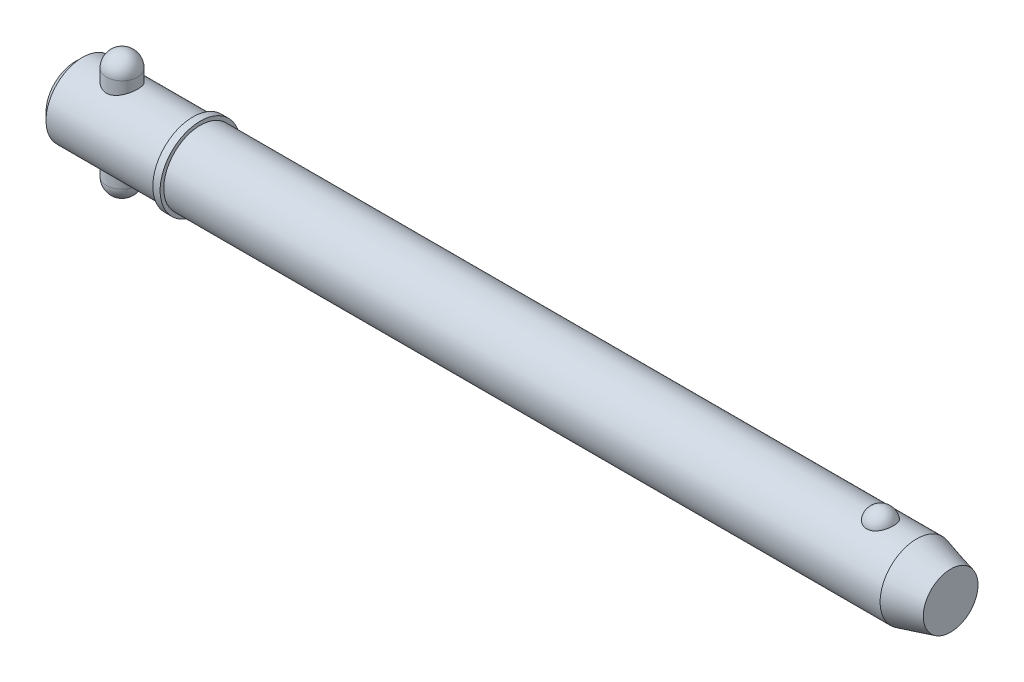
ISO-10303-21;
HEADER;
FILE_DESCRIPTION(('STEP AP214'),'2;1');
FILE_NAME('part.step','',(''),(''),'','','');
FILE_SCHEMA(('AUTOMOTIVE_DESIGN { 1 0 10303 214 1 1 1 1 }'));
ENDSEC;
DATA;
#1=APPLICATION_CONTEXT('core data for automotive mechanical design processes');
#2=APPLICATION_PROTOCOL_DEFINITION('international standard','automotive_design',2000,#1);
#3=PRODUCT_CONTEXT('',#1,'mechanical');
#4=PRODUCT('Part','Part','',(#3));
#5=PRODUCT_RELATED_PRODUCT_CATEGORY('part','',(#4));
#6=PRODUCT_DEFINITION_FORMATION('','',#4);
#7=PRODUCT_DEFINITION_CONTEXT('part definition',#1,'design');
#8=PRODUCT_DEFINITION('design','',#6,#7);
#9=PRODUCT_DEFINITION_SHAPE('','',#8);
#10=(LENGTH_UNIT() NAMED_UNIT(*) SI_UNIT(.MILLI.,.METRE.));
#11=(NAMED_UNIT(*) PLANE_ANGLE_UNIT() SI_UNIT($,.RADIAN.));
#12=(NAMED_UNIT(*) SI_UNIT($,.STERADIAN.) SOLID_ANGLE_UNIT());
#13=UNCERTAINTY_MEASURE_WITH_UNIT(LENGTH_MEASURE(1.E-05),#10,'distance_accuracy_value','');
#14=(GEOMETRIC_REPRESENTATION_CONTEXT(3) GLOBAL_UNCERTAINTY_ASSIGNED_CONTEXT((#13)) GLOBAL_UNIT_ASSIGNED_CONTEXT((#10,
#11,#12)) REPRESENTATION_CONTEXT('',''));
#15=CARTESIAN_POINT('',(0.,0.,0.));
#16=DIRECTION('',(0.,0.,1.));
#17=DIRECTION('',(1.,0.,0.));
#18=AXIS2_PLACEMENT_3D('',#15,#16,#17);
#19=CARTESIAN_POINT('',(14.28,19.05,0.));
#20=DIRECTION('',(0.,-1.,0.));
#21=DIRECTION('',(0.,0.,-1.));
#22=AXIS2_PLACEMENT_3D('',#19,#20,#21);
#23=CYLINDRICAL_SURFACE('',#22,4.76);
#24=CARTESIAN_POINT('',(14.28,-14.29,0.));
#25=DIRECTION('',(0.,-1.,0.));
#26=DIRECTION('',(0.,0.,-1.));
#27=AXIS2_PLACEMENT_3D('',#24,#25,#26);
#28=CIRCLE('',#27,4.76);
#29=CARTESIAN_POINT('',(14.28,-14.29,-4.76));
#30=VERTEX_POINT('',#29);
#31=EDGE_CURVE('P0_E10',#30,#30,#28,.F.);
#32=CARTESIAN_POINT('',(14.28,14.29,0.));
#33=DIRECTION('',(0.,-1.,0.));
#34=DIRECTION('',(0.,0.,-1.));
#35=AXIS2_PLACEMENT_3D('',#32,#33,#34);
#36=CIRCLE('',#35,4.76);
#37=CARTESIAN_POINT('',(14.28,14.29,-4.76));
#38=VERTEX_POINT('',#37);
#39=EDGE_CURVE('P0_E21',#38,#38,#36,.T.);
#40=CARTESIAN_POINT('',(14.28,-14.29,-4.76));
#41=CARTESIAN_POINT('',(14.28,-13.9922916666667,-4.76));
#42=CARTESIAN_POINT('',(14.28,-13.6945833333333,-4.76));
#43=CARTESIAN_POINT('',(14.28,-13.0991666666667,-4.76));
#44=CARTESIAN_POINT('',(14.28,-12.8014583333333,-4.76));
#45=CARTESIAN_POINT('',(14.28,-12.2060416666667,-4.76));
#46=CARTESIAN_POINT('',(14.28,-11.9083333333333,-4.76));
#47=CARTESIAN_POINT('',(14.28,-11.3129166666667,-4.76));
#48=CARTESIAN_POINT('',(14.28,-11.0152083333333,-4.76));
#49=CARTESIAN_POINT('',(14.28,-10.4197916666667,-4.76));
#50=CARTESIAN_POINT('',(14.28,-10.1220833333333,-4.76));
#51=CARTESIAN_POINT('',(14.28,-9.52666666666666,-4.76));
#52=CARTESIAN_POINT('',(14.28,-9.22895833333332,-4.76));
#53=CARTESIAN_POINT('',(14.28,-8.63354166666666,-4.76));
#54=CARTESIAN_POINT('',(14.28,-8.33583333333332,-4.76));
#55=CARTESIAN_POINT('',(14.28,-7.74041666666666,-4.76));
#56=CARTESIAN_POINT('',(14.28,-7.44270833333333,-4.76));
#57=CARTESIAN_POINT('',(14.28,-6.84729166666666,-4.76));
#58=CARTESIAN_POINT('',(14.28,-6.54958333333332,-4.76));
#59=CARTESIAN_POINT('',(14.28,-5.95416666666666,-4.76));
#60=CARTESIAN_POINT('',(14.28,-5.65645833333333,-4.76));
#61=CARTESIAN_POINT('',(14.28,-5.06104166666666,-4.76));
#62=CARTESIAN_POINT('',(14.28,-4.76333333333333,-4.76));
#63=CARTESIAN_POINT('',(14.28,-4.16791666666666,-4.76));
#64=CARTESIAN_POINT('',(14.28,-3.87020833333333,-4.76));
#65=CARTESIAN_POINT('',(14.28,-3.27479166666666,-4.76));
#66=CARTESIAN_POINT('',(14.28,-2.97708333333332,-4.76));
#67=CARTESIAN_POINT('',(14.28,-2.38166666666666,-4.76));
#68=CARTESIAN_POINT('',(14.28,-2.08395833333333,-4.76));
#69=CARTESIAN_POINT('',(14.28,-1.48854166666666,-4.76));
#70=CARTESIAN_POINT('',(14.28,-1.19083333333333,-4.76));
#71=CARTESIAN_POINT('',(14.28,-0.595416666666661,-4.76));
#72=CARTESIAN_POINT('',(14.28,-0.297708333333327,-4.76));
#73=CARTESIAN_POINT('',(14.28,0.297708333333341,-4.76));
#74=CARTESIAN_POINT('',(14.28,0.595416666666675,-4.76));
#75=CARTESIAN_POINT('',(14.28,1.19083333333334,-4.76));
#76=CARTESIAN_POINT('',(14.28,1.48854166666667,-4.76));
#77=CARTESIAN_POINT('',(14.28,2.08395833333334,-4.76));
#78=CARTESIAN_POINT('',(14.28,2.38166666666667,-4.76));
#79=CARTESIAN_POINT('',(14.28,2.97708333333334,-4.76));
#80=CARTESIAN_POINT('',(14.28,3.27479166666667,-4.76));
#81=CARTESIAN_POINT('',(14.28,3.87020833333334,-4.76));
#82=CARTESIAN_POINT('',(14.28,4.16791666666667,-4.76));
#83=CARTESIAN_POINT('',(14.28,4.76333333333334,-4.76));
#84=CARTESIAN_POINT('',(14.28,5.06104166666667,-4.76));
#85=CARTESIAN_POINT('',(14.28,5.65645833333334,-4.76));
#86=CARTESIAN_POINT('',(14.28,5.95416666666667,-4.76));
#87=CARTESIAN_POINT('',(14.28,6.54958333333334,-4.76));
#88=CARTESIAN_POINT('',(14.28,6.84729166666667,-4.76));
#89=CARTESIAN_POINT('',(14.28,7.44270833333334,-4.76));
#90=CARTESIAN_POINT('',(14.28,7.74041666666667,-4.76));
#91=CARTESIAN_POINT('',(14.28,8.33583333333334,-4.76));
#92=CARTESIAN_POINT('',(14.28,8.63354166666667,-4.76));
#93=CARTESIAN_POINT('',(14.28,9.22895833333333,-4.76));
#94=CARTESIAN_POINT('',(14.28,9.52666666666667,-4.76));
#95=CARTESIAN_POINT('',(14.28,10.1220833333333,-4.76));
#96=CARTESIAN_POINT('',(14.28,10.4197916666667,-4.76));
#97=CARTESIAN_POINT('',(14.28,11.0152083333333,-4.76));
#98=CARTESIAN_POINT('',(14.28,11.3129166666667,-4.76));
#99=CARTESIAN_POINT('',(14.28,11.9083333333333,-4.76));
#100=CARTESIAN_POINT('',(14.28,12.2060416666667,-4.76));
#101=CARTESIAN_POINT('',(14.28,12.8014583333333,-4.76));
#102=CARTESIAN_POINT('',(14.28,13.0991666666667,-4.76));
#103=CARTESIAN_POINT('',(14.28,13.6945833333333,-4.76));
#104=CARTESIAN_POINT('',(14.28,13.9922916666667,-4.76));
#105=CARTESIAN_POINT('',(14.28,14.29,-4.76));
#106=B_SPLINE_CURVE_WITH_KNOTS('',3,(#40,#41,#42,#43,#44,#45,#46,#47,#48,#49,#50,#51,#52,#53,
#54,#55,#56,#57,#58,#59,#60,#61,#62,#63,#64,#65,#66,#67,#68,#69,#70,#71,#72,#73,#74,#75,#76,#77,
#78,#79,#80,#81,#82,#83,#84,#85,#86,#87,#88,#89,#90,#91,#92,#93,#94,#95,#96,#97,#98,#99,#100,
#101,#102,#103,#104,#105),.UNSPECIFIED.,.F.,.F.,(4,2,2,2,2,2,2,2,2,2,2,2,2,2,2,2,2,2,2,2,2,2,2,
2,2,2,2,2,2,2,2,2,4),(0.,0.893125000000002,1.78625,2.67937499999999,3.5725,4.465625,5.35875,
6.25187499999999,7.145,8.038125,8.93125,9.82437499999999,10.7175,11.610625,12.50375,13.396875,
14.29,15.183125,16.07625,16.969375,17.8625,18.755625,19.64875,20.541875,21.435,22.328125,
23.22125,24.114375,25.0075,25.900625,26.79375,27.686875,28.58),.UNSPECIFIED.);
#107=EDGE_CURVE('P0_BSEAM14',#30,#38,#106,.T.);
#108=ORIENTED_EDGE('',*,*,#31,.T.);
#109=ORIENTED_EDGE('',*,*,#39,.T.);
#110=ORIENTED_EDGE('',*,*,#107,.T.);
#111=ORIENTED_EDGE('',*,*,#107,.F.);
#112=EDGE_LOOP('',(#108,#110,#109,#111));
#113=FACE_BOUND('',#112,.T.);
#114=ADVANCED_FACE('P0_F14',(#113),#23,.T.);
#115=CARTESIAN_POINT('',(14.28,-14.29,0.));
#116=DIRECTION('',(0.,0.,1.));
#117=DIRECTION('',(1.,0.,0.));
#118=AXIS2_PLACEMENT_3D('',#115,#116,#117);
#119=SPHERICAL_SURFACE('',#118,4.76);
#120=CARTESIAN_POINT('',(14.28,-14.29,0.));
#121=DIRECTION('',(0.,-1.,0.));
#122=DIRECTION('',(0.,0.,-1.));
#123=AXIS2_PLACEMENT_3D('',#120,#121,#122);
#124=SPHERICAL_SURFACE('',#123,4.76);
#125=ORIENTED_EDGE('',*,*,#31,.F.);
#126=EDGE_LOOP('',(#125));
#127=FACE_BOUND('',#126,.T.);
#128=ADVANCED_FACE('P0_F29',(#127),#124,.T.);
#129=CARTESIAN_POINT('',(14.28,14.29,0.));
#130=DIRECTION('',(0.,0.,1.));
#131=DIRECTION('',(1.,0.,0.));
#132=AXIS2_PLACEMENT_3D('',#129,#130,#131);
#133=SPHERICAL_SURFACE('',#132,4.76);
#134=CARTESIAN_POINT('',(14.28,14.29,0.));
#135=DIRECTION('',(0.,-1.,0.));
#136=DIRECTION('',(0.,0.,-1.));
#137=AXIS2_PLACEMENT_3D('',#134,#135,#136);
#138=SPHERICAL_SURFACE('',#137,4.76);
#139=ORIENTED_EDGE('',*,*,#39,.F.);
#140=EDGE_LOOP('',(#139));
#141=FACE_BOUND('',#140,.T.);
#142=ADVANCED_FACE('P0_F16',(#141),#138,.T.);
#143=CLOSED_SHELL('',(#114,#128,#142));
#144=MANIFOLD_SOLID_BREP('P0_B1',#143);
#145=CARTESIAN_POINT('',(0.,0.,0.));
#146=DIRECTION('',(1.,0.,0.));
#147=DIRECTION('',(0.,0.,-1.));
#148=AXIS2_PLACEMENT_3D('',#145,#146,#147);
#149=CYLINDRICAL_SURFACE('',#148,11.115);
#150=CARTESIAN_POINT('',(256.329563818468,0.,0.));
#151=DIRECTION('',(1.,0.,0.));
#152=DIRECTION('',(0.,0.,-1.));
#153=AXIS2_PLACEMENT_3D('',#150,#151,#152);
#154=CIRCLE('',#153,11.115);
#155=CARTESIAN_POINT('',(256.329563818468,0.,-11.115));
#156=VERTEX_POINT('',#155);
#157=EDGE_CURVE('P1_E81',#156,#156,#154,.T.);
#158=ORIENTED_EDGE('',*,*,#157,.F.);
#159=EDGE_LOOP('',(#158));
#160=FACE_BOUND('',#159,.T.);
#161=CARTESIAN_POINT('',(38.1,0.,0.));
#162=DIRECTION('',(1.,0.,0.));
#163=DIRECTION('',(0.,0.,-1.));
#164=AXIS2_PLACEMENT_3D('',#161,#162,#163);
#165=CIRCLE('',#164,11.115);
#166=CARTESIAN_POINT('',(38.1,0.,-11.115));
#167=VERTEX_POINT('',#166);
#168=EDGE_CURVE('P1_E85',#167,#167,#165,.T.);
#169=ORIENTED_EDGE('',*,*,#168,.T.);
#170=EDGE_LOOP('',(#169));
#171=FACE_BOUND('',#170,.T.);
#172=CARTESIAN_POINT('',(245.331068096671,10.3028087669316,4.17077409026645));
#173=CARTESIAN_POINT('',(245.114775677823,10.3028003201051,4.17078240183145));
#174=CARTESIAN_POINT('',(244.898548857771,10.3098895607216,4.15340593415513));
#175=CARTESIAN_POINT('',(244.472540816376,10.3373834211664,4.08449540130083));
#176=CARTESIAN_POINT('',(244.262757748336,10.3577841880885,4.0329712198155));
#177=CARTESIAN_POINT('',(243.855782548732,10.4095237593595,3.89746513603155));
#178=CARTESIAN_POINT('',(243.658572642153,10.4408466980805,3.81353029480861));
#179=CARTESIAN_POINT('',(243.281338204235,10.5110236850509,3.61560339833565));
#180=CARTESIAN_POINT('',(243.101317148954,10.5498792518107,3.50160528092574));
#181=CARTESIAN_POINT('',(242.757684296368,10.6322884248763,3.24292464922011));
#182=CARTESIAN_POINT('',(242.594686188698,10.6759443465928,3.09746040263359));
#183=CARTESIAN_POINT('',(242.294591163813,10.7625291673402,2.7817192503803));
#184=CARTESIAN_POINT('',(242.157499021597,10.8054579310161,2.61143778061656));
#185=CARTESIAN_POINT('',(241.906408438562,10.8881935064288,2.24226695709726));
#186=CARTESIAN_POINT('',(241.793710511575,10.9277761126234,2.04244123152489));
#187=CARTESIAN_POINT('',(241.601777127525,10.997484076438,1.62578254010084));
#188=CARTESIAN_POINT('',(241.522544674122,11.0276085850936,1.40894804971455));
#189=CARTESIAN_POINT('',(241.398303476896,11.0756732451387,0.961250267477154));
#190=CARTESIAN_POINT('',(241.353760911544,11.0934470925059,0.730239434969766));
#191=CARTESIAN_POINT('',(241.301569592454,11.1143331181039,0.263439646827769));
#192=CARTESIAN_POINT('',(241.293920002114,11.1174456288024,0.027650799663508));
#193=CARTESIAN_POINT('',(241.31561056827,11.1087161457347,-0.440729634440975));
#194=CARTESIAN_POINT('',(241.344762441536,11.0969502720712,-0.673331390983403));
#195=CARTESIAN_POINT('',(241.439143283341,11.0597872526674,-1.12996621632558));
#196=CARTESIAN_POINT('',(241.504372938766,11.0343898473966,-1.35399912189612));
#197=CARTESIAN_POINT('',(241.66969844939,10.972515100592,-1.78750286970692));
#198=CARTESIAN_POINT('',(241.76983863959,10.9360236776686,-1.99695478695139));
#199=CARTESIAN_POINT('',(242.002940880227,10.8557595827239,-2.3952066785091));
#200=CARTESIAN_POINT('',(242.135905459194,10.8119863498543,-2.5840050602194));
#201=CARTESIAN_POINT('',(242.432407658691,10.7216733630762,-2.93635726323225));
#202=CARTESIAN_POINT('',(242.596056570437,10.675123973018,-3.09981510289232));
#203=CARTESIAN_POINT('',(242.949860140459,10.5846571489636,-3.39592247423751));
#204=CARTESIAN_POINT('',(243.140012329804,10.5407394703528,-3.52857487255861));
#205=CARTESIAN_POINT('',(243.53750141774,10.4616690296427,-3.75646057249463));
#206=CARTESIAN_POINT('',(243.74436705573,10.4263443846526,-3.85245432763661));
#207=CARTESIAN_POINT('',(244.172954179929,10.3675574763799,-4.00798747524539));
#208=CARTESIAN_POINT('',(244.394670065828,10.344090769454,-4.0675405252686));
#209=CARTESIAN_POINT('',(244.834669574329,10.3128282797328,-4.14614314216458));
#210=CARTESIAN_POINT('',(245.052565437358,10.3043040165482,-4.1670783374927));
#211=CARTESIAN_POINT('',(245.48894951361,10.3016771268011,-4.17357158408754));
#212=CARTESIAN_POINT('',(245.707437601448,10.3075716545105,-4.15913661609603));
#213=CARTESIAN_POINT('',(246.131744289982,10.3326686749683,-4.09636961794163));
#214=CARTESIAN_POINT('',(246.337745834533,10.3514555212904,-4.0490957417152));
#215=CARTESIAN_POINT('',(246.738576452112,10.399818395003,-3.92320197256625));
#216=CARTESIAN_POINT('',(246.9334046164,10.4293952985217,-3.84457953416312));
#217=CARTESIAN_POINT('',(247.311191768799,10.4969600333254,-3.65612410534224));
#218=CARTESIAN_POINT('',(247.493797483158,10.5351178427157,-3.54564545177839));
#219=CARTESIAN_POINT('',(247.838204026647,10.6154999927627,-3.29718036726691));
#220=CARTESIAN_POINT('',(248.000000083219,10.657725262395,-3.15918764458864));
#221=CARTESIAN_POINT('',(248.306959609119,10.744212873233,-2.85163580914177));
#222=CARTESIAN_POINT('',(248.450891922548,10.7884718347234,-2.68084605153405));
#223=CARTESIAN_POINT('',(248.709237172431,10.872374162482,-2.31721864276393));
#224=CARTESIAN_POINT('',(248.823644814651,10.9120167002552,-2.12437704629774));
#225=CARTESIAN_POINT('',(249.023873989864,10.9838919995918,-1.71516999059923));
#226=CARTESIAN_POINT('',(249.10866178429,11.0158465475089,-1.49824866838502));
#227=CARTESIAN_POINT('',(249.24268382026,11.0673523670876,-1.05228572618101));
#228=CARTESIAN_POINT('',(249.291917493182,11.086903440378,-0.823243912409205));
#229=CARTESIAN_POINT('',(249.353891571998,11.1116323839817,-0.359087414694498));
#230=CARTESIAN_POINT('',(249.366566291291,11.1167843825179,-0.123962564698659));
#231=CARTESIAN_POINT('',(249.354973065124,11.1121144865,0.345220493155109));
#232=CARTESIAN_POINT('',(249.330705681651,11.1022928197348,0.579278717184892));
#233=CARTESIAN_POINT('',(249.245907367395,11.0687504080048,1.03866534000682));
#234=CARTESIAN_POINT('',(249.185529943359,11.0450885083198,1.26402641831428));
#235=CARTESIAN_POINT('',(249.029853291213,10.9863185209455,1.70076772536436));
#236=CARTESIAN_POINT('',(248.934551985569,10.9512097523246,1.91214712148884));
#237=CARTESIAN_POINT('',(248.710397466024,10.8729733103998,2.316083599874));
#238=CARTESIAN_POINT('',(248.581380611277,10.8298068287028,2.50854240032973));
#239=CARTESIAN_POINT('',(248.292732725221,10.7401896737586,2.86808766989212));
#240=CARTESIAN_POINT('',(248.133102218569,10.6937390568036,3.03517457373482));
#241=CARTESIAN_POINT('',(247.787534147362,10.6029321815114,3.33857581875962));
#242=CARTESIAN_POINT('',(247.601708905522,10.5585680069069,3.47501541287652));
#243=CARTESIAN_POINT('',(247.207875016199,10.4769321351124,3.71390897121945));
#244=CARTESIAN_POINT('',(246.999863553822,10.439661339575,3.81635861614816));
#245=CARTESIAN_POINT('',(246.554066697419,10.3749407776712,3.98910631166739));
#246=CARTESIAN_POINT('',(246.315234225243,10.3482457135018,4.05700929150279));
#247=CARTESIAN_POINT('',(245.827925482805,10.312188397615,4.14782844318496));
#248=CARTESIAN_POINT('',(245.579453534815,10.3028184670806,4.17076454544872));
#249=CARTESIAN_POINT('',(245.331068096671,10.3028087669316,4.17077409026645));
#250=B_SPLINE_CURVE_WITH_KNOTS('',3,(#172,#173,#174,#175,#176,#177,#178,#179,#180,#181,#182,
#183,#184,#185,#186,#187,#188,#189,#190,#191,#192,#193,#194,#195,#196,#197,#198,#199,#200,#201,
#202,#203,#204,#205,#206,#207,#208,#209,#210,#211,#212,#213,#214,#215,#216,#217,#218,#219,#220,
#221,#222,#223,#224,#225,#226,#227,#228,#229,#230,#231,#232,#233,#234,#235,#236,#237,#238,#239,
#240,#241,#242,#243,#244,#245,#246,#247,#248,#249),.UNSPECIFIED.,.T.,.F.,(4,2,2,2,2,2,2,2,2,2,2,
2,2,2,2,2,2,2,2,2,2,2,2,2,2,2,2,2,2,2,2,2,2,2,2,2,2,2,4),(0.,0.64796614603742,1.29574482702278,
1.94258643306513,2.58955857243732,3.25496465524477,3.92049326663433,4.61566368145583,
5.31089647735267,6.01531821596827,6.71972398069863,7.42054043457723,8.12137023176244,
8.82309331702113,9.5248704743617,10.2292439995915,10.9335519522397,11.6223330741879,
12.3108558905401,12.9647664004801,13.6185478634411,14.252184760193,14.8858731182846,
15.5334360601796,16.1811472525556,16.8611459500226,17.5412664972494,18.2431855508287,
18.9451158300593,19.6483065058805,20.3514864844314,21.0516982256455,21.7519516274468,
22.4556690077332,23.1593743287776,23.860149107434,24.5610129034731,25.3054529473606,
26.049562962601),.UNSPECIFIED.);
#251=CARTESIAN_POINT('',(245.331068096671,10.3028087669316,4.17077409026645));
#252=VERTEX_POINT('',#251);
#253=EDGE_CURVE('P1_E35',#252,#252,#250,.T.);
#254=ORIENTED_EDGE('',*,*,#253,.T.);
#255=EDGE_LOOP('',(#254));
#256=FACE_BOUND('',#255,.T.);
#257=ADVANCED_FACE('P1_F13',(#160,#171,#256),#149,.T.);
#258=CARTESIAN_POINT('',(0.,0.,0.));
#259=DIRECTION('',(-1.,0.,0.));
#260=DIRECTION('',(0.,0.,1.));
#261=AXIS2_PLACEMENT_3D('',#258,#259,#260);
#262=PLANE('',#261);
#263=CARTESIAN_POINT('',(0.,0.,0.));
#264=DIRECTION('',(1.,0.,0.));
#265=DIRECTION('',(0.,0.,-1.));
#266=AXIS2_PLACEMENT_3D('',#263,#264,#265);
#267=CIRCLE('',#266,8.892);
#268=CARTESIAN_POINT('',(0.,0.,-8.892));
#269=VERTEX_POINT('',#268);
#270=EDGE_CURVE('P1_E9',#269,#269,#267,.T.);
#271=ORIENTED_EDGE('',*,*,#270,.F.);
#272=EDGE_LOOP('',(#271));
#273=FACE_BOUND('',#272,.T.);
#274=ADVANCED_FACE('P1_F15',(#273),#262,.T.);
#275=CARTESIAN_POINT('',(2.22299999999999,0.,0.));
#276=DIRECTION('',(1.,0.,0.));
#277=DIRECTION('',(0.,0.,-1.));
#278=AXIS2_PLACEMENT_3D('',#275,#276,#277);
#279=CONICAL_SURFACE('',#278,11.115,0.78539816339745);
#280=ORIENTED_EDGE('',*,*,#270,.T.);
#281=EDGE_LOOP('',(#280));
#282=FACE_BOUND('',#281,.T.);
#283=CARTESIAN_POINT('',(2.22299999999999,0.,0.));
#284=DIRECTION('',(1.,0.,0.));
#285=DIRECTION('',(0.,0.,-1.));
#286=AXIS2_PLACEMENT_3D('',#283,#284,#285);
#287=CIRCLE('',#286,11.115);
#288=CARTESIAN_POINT('',(2.22299999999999,0.,-11.115));
#289=VERTEX_POINT('',#288);
#290=EDGE_CURVE('P1_E26',#289,#289,#287,.T.);
#291=ORIENTED_EDGE('',*,*,#290,.F.);
#292=EDGE_LOOP('',(#291));
#293=FACE_BOUND('',#292,.T.);
#294=ADVANCED_FACE('P1_F77',(#282,#293),#279,.T.);
#295=CARTESIAN_POINT('',(0.,0.,0.));
#296=DIRECTION('',(1.,0.,0.));
#297=DIRECTION('',(0.,0.,-1.));
#298=AXIS2_PLACEMENT_3D('',#295,#296,#297);
#299=CYLINDRICAL_SURFACE('',#298,11.115);
#300=CARTESIAN_POINT('',(14.28,-10.0441836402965,4.76));
#301=CARTESIAN_POINT('',(14.1533731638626,-10.0441846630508,4.75999904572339));
#302=CARTESIAN_POINT('',(14.0267055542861,-10.0465865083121,4.75493985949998));
#303=CARTESIAN_POINT('',(13.774298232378,-10.0561141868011,4.73475585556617));
#304=CARTESIAN_POINT('',(13.6485591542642,-10.0632429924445,4.71962470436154));
#305=CARTESIAN_POINT('',(13.3987500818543,-10.0819979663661,4.67942666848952));
#306=CARTESIAN_POINT('',(13.2746840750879,-10.0936334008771,4.65433930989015));
#307=CARTESIAN_POINT('',(13.0293244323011,-10.1210146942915,4.59449317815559));
#308=CARTESIAN_POINT('',(12.9080319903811,-10.1367622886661,4.55973032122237));
#309=CARTESIAN_POINT('',(12.669614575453,-10.1717810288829,4.48106435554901));
#310=CARTESIAN_POINT('',(12.5524727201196,-10.1910352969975,4.4372048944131));
#311=CARTESIAN_POINT('',(12.3224300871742,-10.2325403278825,4.34063417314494));
#312=CARTESIAN_POINT('',(12.2095309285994,-10.2547922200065,4.28791957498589));
#313=CARTESIAN_POINT('',(11.8782785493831,-10.3250879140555,4.11715127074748));
#314=CARTESIAN_POINT('',(11.6670799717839,-10.3767168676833,3.98637638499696));
#315=CARTESIAN_POINT('',(11.2564039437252,-10.4874309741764,3.68567149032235));
#316=CARTESIAN_POINT('',(11.0583793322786,-10.5467772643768,3.51386978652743));
#317=CARTESIAN_POINT('',(10.6927724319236,-10.6641377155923,3.13969960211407));
#318=CARTESIAN_POINT('',(10.5252022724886,-10.7221513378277,2.93731900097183));
#319=CARTESIAN_POINT('',(10.2965609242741,-10.8050020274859,2.60935726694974));
#320=CARTESIAN_POINT('',(10.2227768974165,-10.8324811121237,2.49310321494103));
#321=CARTESIAN_POINT('',(10.0853380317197,-10.884703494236,2.25418999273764));
#322=CARTESIAN_POINT('',(10.0216789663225,-10.9094479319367,2.13153352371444));
#323=CARTESIAN_POINT('',(9.90506238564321,-10.9554932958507,1.88060370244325));
#324=CARTESIAN_POINT('',(9.85210574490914,-10.9767939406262,1.7523298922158));
#325=CARTESIAN_POINT('',(9.75746464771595,-11.0153112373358,1.49115740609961));
#326=CARTESIAN_POINT('',(9.71577447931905,-11.0325299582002,1.35826111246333));
#327=CARTESIAN_POINT('',(9.64605475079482,-11.0615607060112,1.09614539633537));
#328=CARTESIAN_POINT('',(9.61740732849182,-11.0736151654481,0.96711700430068));
#329=CARTESIAN_POINT('',(9.57092026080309,-11.0932687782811,0.706847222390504));
#330=CARTESIAN_POINT('',(9.55307574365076,-11.1008699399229,0.575606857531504));
#331=CARTESIAN_POINT('',(9.52838640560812,-11.1114054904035,0.31192917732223));
#332=CARTESIAN_POINT('',(9.52153986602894,-11.114340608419,0.179492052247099));
#333=CARTESIAN_POINT('',(9.51892405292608,-11.1154607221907,-0.0855090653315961));
#334=CARTESIAN_POINT('',(9.52315432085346,-11.1136459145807,-0.218073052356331));
#335=CARTESIAN_POINT('',(9.542009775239,-11.1055891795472,-0.473709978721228));
#336=CARTESIAN_POINT('',(9.55594693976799,-11.099640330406,-0.596843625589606));
#337=CARTESIAN_POINT('',(9.59332832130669,-11.0837823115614,-0.841440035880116));
#338=CARTESIAN_POINT('',(9.61677567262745,-11.0738718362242,-0.962902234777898));
#339=CARTESIAN_POINT('',(9.67294089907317,-11.0503378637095,-1.20325684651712));
#340=CARTESIAN_POINT('',(9.70565569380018,-11.0367156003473,-1.32215009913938));
#341=CARTESIAN_POINT('',(9.78005008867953,-11.0060908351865,-1.55666640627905));
#342=CARTESIAN_POINT('',(9.82173311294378,-10.9890870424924,-1.67228819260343));
#343=CARTESIAN_POINT('',(9.96110379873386,-10.9330280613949,-2.01656166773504));
#344=CARTESIAN_POINT('',(10.0722987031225,-10.8892801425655,-2.23915547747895));
#345=CARTESIAN_POINT('',(10.3268588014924,-10.7934745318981,-2.66299199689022));
#346=CARTESIAN_POINT('',(10.4702355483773,-10.7414138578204,-2.86422700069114));
#347=CARTESIAN_POINT('',(10.7973904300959,-10.6296201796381,-3.25557775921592));
#348=CARTESIAN_POINT('',(10.9833705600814,-10.569604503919,-3.443774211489));
#349=CARTESIAN_POINT('',(11.3844486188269,-10.4514707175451,-3.78722133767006));
#350=CARTESIAN_POINT('',(11.5995590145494,-10.3933534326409,-3.94245783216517));
#351=CARTESIAN_POINT('',(11.9444340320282,-10.311516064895,-4.14990014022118));
#352=CARTESIAN_POINT('',(12.0654579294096,-10.2847012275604,-4.21573894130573));
#353=CARTESIAN_POINT('',(12.3132718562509,-10.2342051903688,-4.33688518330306));
#354=CARTESIAN_POINT('',(12.4400593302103,-10.2105226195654,-4.39219723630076));
#355=CARTESIAN_POINT('',(12.6985418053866,-10.1671237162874,-4.49174500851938));
#356=CARTESIAN_POINT('',(12.8302359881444,-10.1474067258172,-4.53598256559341));
#357=CARTESIAN_POINT('',(13.0975061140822,-10.1126841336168,-4.61287629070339));
#358=CARTESIAN_POINT('',(13.233079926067,-10.0976759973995,-4.64553869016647));
#359=CARTESIAN_POINT('',(13.4978553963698,-10.0737863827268,-4.6971059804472));
#360=CARTESIAN_POINT('',(13.6268754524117,-10.0645618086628,-4.716785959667));
#361=CARTESIAN_POINT('',(13.8862990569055,-10.051062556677,-4.74548419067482));
#362=CARTESIAN_POINT('',(14.0167019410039,-10.0467856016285,-4.75450734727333));
#363=CARTESIAN_POINT('',(14.277859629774,-10.0433352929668,-4.76179143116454));
#364=CARTESIAN_POINT('',(14.4086143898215,-10.0441613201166,-4.76005366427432));
#365=CARTESIAN_POINT('',(14.6694025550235,-10.0508838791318,-4.74584231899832));
#366=CARTESIAN_POINT('',(14.7994359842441,-10.0567802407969,-4.73336910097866));
#367=CARTESIAN_POINT('',(15.0487369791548,-10.0728449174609,-4.69907984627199));
#368=CARTESIAN_POINT('',(15.1681238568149,-10.0826872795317,-4.67797462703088));
#369=CARTESIAN_POINT('',(15.4045894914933,-10.1062580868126,-4.62682977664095));
#370=CARTESIAN_POINT('',(15.5216674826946,-10.1199877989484,-4.59678723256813));
#371=CARTESIAN_POINT('',(15.868278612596,-10.1664161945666,-4.49365911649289));
#372=CARTESIAN_POINT('',(16.0933756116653,-10.2043671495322,-4.40754694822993));
#373=CARTESIAN_POINT('',(16.5357981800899,-10.2919879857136,-4.19898201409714));
#374=CARTESIAN_POINT('',(16.7523611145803,-10.3420954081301,-4.07511281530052));
#375=CARTESIAN_POINT('',(17.1627188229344,-10.4477911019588,-3.7959429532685));
#376=CARTESIAN_POINT('',(17.3565033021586,-10.5033818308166,-3.64062816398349));
#377=CARTESIAN_POINT('',(17.7334034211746,-10.6196376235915,-3.28693729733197));
#378=CARTESIAN_POINT('',(17.9141276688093,-10.6803237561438,-3.08599175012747));
#379=CARTESIAN_POINT('',(18.1582189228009,-10.7666348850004,-2.76320365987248));
#380=CARTESIAN_POINT('',(18.2351223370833,-10.7946346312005,-2.65197124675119));
#381=CARTESIAN_POINT('',(18.3793967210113,-10.8483267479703,-2.42297927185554));
#382=CARTESIAN_POINT('',(18.4467718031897,-10.87402011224,-2.30522255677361));
#383=CARTESIAN_POINT('',(18.5717669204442,-10.9225249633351,-2.06324665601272));
#384=CARTESIAN_POINT('',(18.6293326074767,-10.9453202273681,-1.93899615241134));
#385=CARTESIAN_POINT('',(18.73370006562,-10.9872100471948,-1.6855059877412));
#386=CARTESIAN_POINT('',(18.7805065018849,-11.0063062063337,-1.55626851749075));
#387=CARTESIAN_POINT('',(18.8628731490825,-11.0402419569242,-1.29375150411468));
#388=CARTESIAN_POINT('',(18.8984366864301,-11.0550828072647,-1.16047316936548));
#389=CARTESIAN_POINT('',(18.9579183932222,-11.0800638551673,-0.890912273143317));
#390=CARTESIAN_POINT('',(18.9818374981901,-11.0902044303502,-0.75462995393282));
#391=CARTESIAN_POINT('',(19.0164177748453,-11.104911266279,-0.490295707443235));
#392=CARTESIAN_POINT('',(19.027922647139,-11.1098318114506,-0.362373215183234));
#393=CARTESIAN_POINT('',(19.040554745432,-11.1152360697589,-0.105876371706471));
#394=CARTESIAN_POINT('',(19.0416784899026,-11.1157182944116,0.0226981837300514));
#395=CARTESIAN_POINT('',(19.0335275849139,-11.1122291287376,0.27938352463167));
#396=CARTESIAN_POINT('',(19.0242587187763,-11.1082602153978,0.407494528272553));
#397=CARTESIAN_POINT('',(18.9954320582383,-11.0959792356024,0.662388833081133));
#398=CARTESIAN_POINT('',(18.9758704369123,-11.0876655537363,0.789171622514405));
#399=CARTESIAN_POINT('',(18.9276379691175,-11.0673259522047,1.03545890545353));
#400=CARTESIAN_POINT('',(18.8993573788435,-11.0554596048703,1.15505309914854));
#401=CARTESIAN_POINT('',(18.8337694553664,-11.0282166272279,1.39134516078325));
#402=CARTESIAN_POINT('',(18.7964589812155,-11.0128387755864,1.5080420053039));
#403=CARTESIAN_POINT('',(18.671464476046,-10.9619666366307,1.85262797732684));
#404=CARTESIAN_POINT('',(18.5706772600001,-10.9217161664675,2.07521484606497));
#405=CARTESIAN_POINT('',(18.33202463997,-10.8301378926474,2.51061719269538));
#406=CARTESIAN_POINT('',(18.1926775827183,-10.7783885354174,2.72252375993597));
#407=CARTESIAN_POINT('',(17.8829747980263,-10.669863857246,3.12088015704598));
#408=CARTESIAN_POINT('',(17.7126068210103,-10.6130865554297,3.30731987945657));
#409=CARTESIAN_POINT('',(17.3310036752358,-10.495668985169,3.66358491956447));
#410=CARTESIAN_POINT('',(17.1177010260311,-10.4350471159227,3.83122543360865));
#411=CARTESIAN_POINT('',(16.7778915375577,-10.3495418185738,4.05420569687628));
#412=CARTESIAN_POINT('',(16.6612023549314,-10.3219229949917,4.12383380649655));
#413=CARTESIAN_POINT('',(16.4218466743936,-10.2693487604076,4.25306463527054));
#414=CARTESIAN_POINT('',(16.2991829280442,-10.2443921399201,4.31267191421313));
#415=CARTESIAN_POINT('',(16.0488008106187,-10.1979981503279,4.42126071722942));
#416=CARTESIAN_POINT('',(15.9210894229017,-10.1765561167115,4.47025635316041));
#417=CARTESIAN_POINT('',(15.6613937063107,-10.1379191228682,4.55720152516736));
#418=CARTESIAN_POINT('',(15.5294115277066,-10.1207220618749,4.59515652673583));
#419=CARTESIAN_POINT('',(15.2624981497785,-10.091252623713,4.65951684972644));
#420=CARTESIAN_POINT('',(15.1275757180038,-10.0789672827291,4.68595259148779));
#421=CARTESIAN_POINT('',(14.8556442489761,-10.0597530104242,4.72706206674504));
#422=CARTESIAN_POINT('',(14.7186368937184,-10.0528199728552,4.74174481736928));
#423=CARTESIAN_POINT('',(14.5310955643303,-10.047196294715,4.75363843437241));
#424=CARTESIAN_POINT('',(14.48091543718,-10.0460674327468,4.75602323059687));
#425=CARTESIAN_POINT('',(14.3804923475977,-10.044560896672,4.7592042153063));
#426=CARTESIAN_POINT('',(14.3302493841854,-10.0441832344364,4.76000037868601));
#427=CARTESIAN_POINT('',(14.28,-10.0441836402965,4.76));
#428=B_SPLINE_CURVE_WITH_KNOTS('',3,(#300,#301,#302,#303,#304,#305,#306,#307,#308,#309,#310,
#311,#312,#313,#314,#315,#316,#317,#318,#319,#320,#321,#322,#323,#324,#325,#326,#327,#328,#329,
#330,#331,#332,#333,#334,#335,#336,#337,#338,#339,#340,#341,#342,#343,#344,#345,#346,#347,#348,
#349,#350,#351,#352,#353,#354,#355,#356,#357,#358,#359,#360,#361,#362,#363,#364,#365,#366,#367,
#368,#369,#370,#371,#372,#373,#374,#375,#376,#377,#378,#379,#380,#381,#382,#383,#384,#385,#386,
#387,#388,#389,#390,#391,#392,#393,#394,#395,#396,#397,#398,#399,#400,#401,#402,#403,#404,#405,
#406,#407,#408,#409,#410,#411,#412,#413,#414,#415,#416,#417,#418,#419,#420,#421,#422,#423,#424,
#425,#426,#427),.UNSPECIFIED.,.T.,.F.,(4,2,2,2,2,2,2,2,2,2,2,2,2,2,2,2,2,2,2,2,2,2,2,2,2,2,2,2,
2,2,2,2,2,2,2,2,2,2,2,2,2,2,2,2,2,2,2,2,2,2,2,2,2,2,2,2,2,2,2,2,2,2,2,4),(0.,0.379828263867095,
0.759895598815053,1.14074858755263,1.52176256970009,1.90098898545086,2.28035867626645,
3.03818035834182,3.84125131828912,4.6446414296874,5.06541657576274,5.48601561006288,
5.90664899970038,6.3270687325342,6.72470503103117,7.12216187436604,7.51955659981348,
7.91693487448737,8.28868404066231,8.66055582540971,9.03230414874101,9.40419465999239,
10.1585834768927,10.9132435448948,11.7236471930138,12.5343987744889,12.9550196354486,
13.3754557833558,13.7958221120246,14.2159617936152,14.6079540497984,14.9997658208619,
15.3915300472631,15.7832811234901,16.1477615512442,16.512360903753,17.240999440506,
18.0012974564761,18.761937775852,19.5886929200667,20.0025782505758,20.4162843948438,
20.832212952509,21.2479608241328,21.6635855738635,22.0791769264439,22.4642880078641,
22.8495282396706,23.2345541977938,23.6197234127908,23.9896813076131,24.3597680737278,
25.099327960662,25.8726239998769,26.6462260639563,27.4759193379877,27.8914891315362,
28.3068693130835,28.7216936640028,29.1363123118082,29.5498292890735,29.9630287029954,
30.113753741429,30.2644811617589),.UNSPECIFIED.);
#429=CARTESIAN_POINT('',(14.28,-10.0441836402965,4.76));
#430=VERTEX_POINT('',#429);
#431=EDGE_CURVE('P1_E17',#430,#430,#428,.T.);
#432=ORIENTED_EDGE('',*,*,#431,.F.);
#433=EDGE_LOOP('',(#432));
#434=FACE_BOUND('',#433,.T.);
#435=CARTESIAN_POINT('',(14.28,10.0441836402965,4.76));
#436=CARTESIAN_POINT('',(14.4066268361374,10.0441846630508,4.75999904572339));
#437=CARTESIAN_POINT('',(14.5332944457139,10.0465865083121,4.75493985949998));
#438=CARTESIAN_POINT('',(14.785701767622,10.0561141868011,4.73475585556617));
#439=CARTESIAN_POINT('',(14.9114408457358,10.0632429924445,4.71962470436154));
#440=CARTESIAN_POINT('',(15.1612499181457,10.0819979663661,4.67942666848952));
#441=CARTESIAN_POINT('',(15.2853159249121,10.0936334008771,4.65433930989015));
#442=CARTESIAN_POINT('',(15.5306755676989,10.1210146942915,4.59449317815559));
#443=CARTESIAN_POINT('',(15.6519680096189,10.1367622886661,4.55973032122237));
#444=CARTESIAN_POINT('',(15.890385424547,10.1717810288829,4.48106435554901));
#445=CARTESIAN_POINT('',(16.0075272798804,10.1910352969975,4.4372048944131));
#446=CARTESIAN_POINT('',(16.2375699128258,10.2325403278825,4.34063417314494));
#447=CARTESIAN_POINT('',(16.3504690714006,10.2547922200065,4.28791957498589));
#448=CARTESIAN_POINT('',(16.6817214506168,10.3250879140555,4.11715127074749));
#449=CARTESIAN_POINT('',(16.8929200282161,10.3767168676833,3.98637638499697));
#450=CARTESIAN_POINT('',(17.3035960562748,10.4874309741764,3.68567149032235));
#451=CARTESIAN_POINT('',(17.5016206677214,10.5467772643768,3.51386978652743));
#452=CARTESIAN_POINT('',(17.8672275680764,10.6641377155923,3.13969960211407));
#453=CARTESIAN_POINT('',(18.0347977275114,10.7221513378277,2.93731900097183));
#454=CARTESIAN_POINT('',(18.2634390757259,10.8050020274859,2.60935726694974));
#455=CARTESIAN_POINT('',(18.3372231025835,10.8324811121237,2.49310321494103));
#456=CARTESIAN_POINT('',(18.4746619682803,10.884703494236,2.25418999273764));
#457=CARTESIAN_POINT('',(18.5383210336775,10.9094479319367,2.13153352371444));
#458=CARTESIAN_POINT('',(18.6549376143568,10.9554932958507,1.88060370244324));
#459=CARTESIAN_POINT('',(18.7078942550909,10.9767939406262,1.75232989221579));
#460=CARTESIAN_POINT('',(18.8025353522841,11.0153112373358,1.4911574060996));
#461=CARTESIAN_POINT('',(18.844225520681,11.0325299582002,1.35826111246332));
#462=CARTESIAN_POINT('',(18.9139452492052,11.0615607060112,1.09614539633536));
#463=CARTESIAN_POINT('',(18.9425926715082,11.0736151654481,0.967117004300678));
#464=CARTESIAN_POINT('',(18.9890797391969,11.0932687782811,0.706847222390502));
#465=CARTESIAN_POINT('',(19.0069242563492,11.1008699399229,0.575606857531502));
#466=CARTESIAN_POINT('',(19.0316135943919,11.1114054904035,0.311929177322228));
#467=CARTESIAN_POINT('',(19.0384601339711,11.114340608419,0.179492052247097));
#468=CARTESIAN_POINT('',(19.0410759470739,11.1154607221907,-0.0855090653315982));
#469=CARTESIAN_POINT('',(19.0368456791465,11.1136459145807,-0.218073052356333));
#470=CARTESIAN_POINT('',(19.017990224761,11.1055891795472,-0.47370997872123));
#471=CARTESIAN_POINT('',(19.004053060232,11.099640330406,-0.596843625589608));
#472=CARTESIAN_POINT('',(18.9666716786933,11.0837823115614,-0.841440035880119));
#473=CARTESIAN_POINT('',(18.9432243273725,11.0738718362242,-0.9629022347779));
#474=CARTESIAN_POINT('',(18.8870591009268,11.0503378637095,-1.20325684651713));
#475=CARTESIAN_POINT('',(18.8543443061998,11.0367156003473,-1.32215009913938));
#476=CARTESIAN_POINT('',(18.7799499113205,11.0060908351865,-1.55666640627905));
#477=CARTESIAN_POINT('',(18.7382668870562,10.9890870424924,-1.67228819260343));
#478=CARTESIAN_POINT('',(18.5988962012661,10.9330280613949,-2.01656166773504));
#479=CARTESIAN_POINT('',(18.4877012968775,10.8892801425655,-2.23915547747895));
#480=CARTESIAN_POINT('',(18.2331411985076,10.7934745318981,-2.66299199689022));
#481=CARTESIAN_POINT('',(18.0897644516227,10.7414138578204,-2.86422700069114));
#482=CARTESIAN_POINT('',(17.7626095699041,10.6296201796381,-3.25557775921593));
#483=CARTESIAN_POINT('',(17.5766294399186,10.569604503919,-3.443774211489));
#484=CARTESIAN_POINT('',(17.1755513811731,10.4514707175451,-3.78722133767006));
#485=CARTESIAN_POINT('',(16.9604409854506,10.3933534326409,-3.94245783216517));
#486=CARTESIAN_POINT('',(16.6155659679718,10.311516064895,-4.14990014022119));
#487=CARTESIAN_POINT('',(16.4945420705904,10.2847012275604,-4.21573894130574));
#488=CARTESIAN_POINT('',(16.2467281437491,10.2342051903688,-4.33688518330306));
#489=CARTESIAN_POINT('',(16.1199406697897,10.2105226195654,-4.39219723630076));
#490=CARTESIAN_POINT('',(15.8614581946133,10.1671237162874,-4.49174500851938));
#491=CARTESIAN_POINT('',(15.7297640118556,10.1474067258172,-4.53598256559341));
#492=CARTESIAN_POINT('',(15.4624938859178,10.1126841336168,-4.61287629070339));
#493=CARTESIAN_POINT('',(15.326920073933,10.0976759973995,-4.64553869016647));
#494=CARTESIAN_POINT('',(15.0621446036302,10.0737863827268,-4.6971059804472));
#495=CARTESIAN_POINT('',(14.9331245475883,10.0645618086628,-4.716785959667));
#496=CARTESIAN_POINT('',(14.6737009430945,10.051062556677,-4.74548419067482));
#497=CARTESIAN_POINT('',(14.543298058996,10.0467856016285,-4.75450734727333));
#498=CARTESIAN_POINT('',(14.2821403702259,10.0433352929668,-4.76179143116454));
#499=CARTESIAN_POINT('',(14.1513856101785,10.0441613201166,-4.76005366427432));
#500=CARTESIAN_POINT('',(13.8905974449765,10.0508838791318,-4.74584231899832));
#501=CARTESIAN_POINT('',(13.7605640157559,10.0567802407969,-4.73336910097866));
#502=CARTESIAN_POINT('',(13.5112630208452,10.0728449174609,-4.69907984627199));
#503=CARTESIAN_POINT('',(13.3918761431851,10.0826872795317,-4.67797462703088));
#504=CARTESIAN_POINT('',(13.1554105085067,10.1062580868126,-4.62682977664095));
#505=CARTESIAN_POINT('',(13.0383325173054,10.1199877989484,-4.59678723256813));
#506=CARTESIAN_POINT('',(12.691721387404,10.1664161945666,-4.49365911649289));
#507=CARTESIAN_POINT('',(12.4666243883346,10.2043671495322,-4.40754694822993));
#508=CARTESIAN_POINT('',(12.0242018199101,10.2919879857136,-4.19898201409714));
#509=CARTESIAN_POINT('',(11.8076388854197,10.3420954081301,-4.07511281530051));
#510=CARTESIAN_POINT('',(11.3972811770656,10.4477911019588,-3.7959429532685));
#511=CARTESIAN_POINT('',(11.2034966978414,10.5033818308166,-3.64062816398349));
#512=CARTESIAN_POINT('',(10.8265965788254,10.6196376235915,-3.28693729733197));
#513=CARTESIAN_POINT('',(10.6458723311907,10.6803237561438,-3.08599175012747));
#514=CARTESIAN_POINT('',(10.4017810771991,10.7666348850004,-2.76320365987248));
#515=CARTESIAN_POINT('',(10.3248776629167,10.7946346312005,-2.65197124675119));
#516=CARTESIAN_POINT('',(10.1806032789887,10.8483267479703,-2.42297927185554));
#517=CARTESIAN_POINT('',(10.1132281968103,10.87402011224,-2.30522255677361));
#518=CARTESIAN_POINT('',(9.98823307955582,10.9225249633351,-2.06324665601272));
#519=CARTESIAN_POINT('',(9.93066739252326,10.9453202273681,-1.93899615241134));
#520=CARTESIAN_POINT('',(9.82629993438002,10.9872100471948,-1.6855059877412));
#521=CARTESIAN_POINT('',(9.77949349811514,11.0063062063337,-1.55626851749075));
#522=CARTESIAN_POINT('',(9.69712685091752,11.0402419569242,-1.29375150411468));
#523=CARTESIAN_POINT('',(9.66156331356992,11.0550828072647,-1.16047316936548));
#524=CARTESIAN_POINT('',(9.60208160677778,11.0800638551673,-0.890912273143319));
#525=CARTESIAN_POINT('',(9.57816250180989,11.0902044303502,-0.754629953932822));
#526=CARTESIAN_POINT('',(9.54358222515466,11.104911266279,-0.490295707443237));
#527=CARTESIAN_POINT('',(9.53207735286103,11.1098318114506,-0.362373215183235));
#528=CARTESIAN_POINT('',(9.51944525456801,11.1152360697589,-0.105876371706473));
#529=CARTESIAN_POINT('',(9.51832151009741,11.1157182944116,0.0226981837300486));
#530=CARTESIAN_POINT('',(9.52647241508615,11.1122291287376,0.279383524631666));
#531=CARTESIAN_POINT('',(9.53574128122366,11.1082602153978,0.407494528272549));
#532=CARTESIAN_POINT('',(9.5645679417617,11.0959792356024,0.662388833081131));
#533=CARTESIAN_POINT('',(9.58412956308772,11.0876655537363,0.789171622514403));
#534=CARTESIAN_POINT('',(9.63236203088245,11.0673259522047,1.03545890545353));
#535=CARTESIAN_POINT('',(9.66064262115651,11.0554596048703,1.15505309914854));
#536=CARTESIAN_POINT('',(9.72623054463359,11.0282166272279,1.39134516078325));
#537=CARTESIAN_POINT('',(9.76354101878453,11.0128387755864,1.5080420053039));
#538=CARTESIAN_POINT('',(9.88853552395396,10.9619666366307,1.85262797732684));
#539=CARTESIAN_POINT('',(9.98932273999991,10.9217161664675,2.07521484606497));
#540=CARTESIAN_POINT('',(10.22797536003,10.8301378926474,2.51061719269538));
#541=CARTESIAN_POINT('',(10.3673224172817,10.7783885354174,2.72252375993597));
#542=CARTESIAN_POINT('',(10.6770252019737,10.669863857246,3.12088015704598));
#543=CARTESIAN_POINT('',(10.8473931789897,10.6130865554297,3.30731987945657));
#544=CARTESIAN_POINT('',(11.2289963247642,10.495668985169,3.66358491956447));
#545=CARTESIAN_POINT('',(11.4422989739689,10.4350471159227,3.83122543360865));
#546=CARTESIAN_POINT('',(11.7821084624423,10.3495418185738,4.05420569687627));
#547=CARTESIAN_POINT('',(11.8987976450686,10.3219229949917,4.12383380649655));
#548=CARTESIAN_POINT('',(12.1381533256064,10.2693487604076,4.25306463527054));
#549=CARTESIAN_POINT('',(12.2608170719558,10.2443921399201,4.31267191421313));
#550=CARTESIAN_POINT('',(12.5111991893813,10.1979981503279,4.42126071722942));
#551=CARTESIAN_POINT('',(12.6389105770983,10.1765561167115,4.47025635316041));
#552=CARTESIAN_POINT('',(12.8986062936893,10.1379191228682,4.55720152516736));
#553=CARTESIAN_POINT('',(13.0305884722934,10.1207220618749,4.59515652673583));
#554=CARTESIAN_POINT('',(13.2975018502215,10.091252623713,4.65951684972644));
#555=CARTESIAN_POINT('',(13.4324242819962,10.0789672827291,4.68595259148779));
#556=CARTESIAN_POINT('',(13.7043557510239,10.0597530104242,4.72706206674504));
#557=CARTESIAN_POINT('',(13.8413631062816,10.0528199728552,4.74174481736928));
#558=CARTESIAN_POINT('',(14.0289044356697,10.047196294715,4.75363843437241));
#559=CARTESIAN_POINT('',(14.07908456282,10.0460674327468,4.75602323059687));
#560=CARTESIAN_POINT('',(14.1795076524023,10.044560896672,4.7592042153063));
#561=CARTESIAN_POINT('',(14.2297506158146,10.0441832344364,4.76000037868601));
#562=CARTESIAN_POINT('',(14.28,10.0441836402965,4.76));
#563=B_SPLINE_CURVE_WITH_KNOTS('',3,(#435,#436,#437,#438,#439,#440,#441,#442,#443,#444,#445,
#446,#447,#448,#449,#450,#451,#452,#453,#454,#455,#456,#457,#458,#459,#460,#461,#462,#463,#464,
#465,#466,#467,#468,#469,#470,#471,#472,#473,#474,#475,#476,#477,#478,#479,#480,#481,#482,#483,
#484,#485,#486,#487,#488,#489,#490,#491,#492,#493,#494,#495,#496,#497,#498,#499,#500,#501,#502,
#503,#504,#505,#506,#507,#508,#509,#510,#511,#512,#513,#514,#515,#516,#517,#518,#519,#520,#521,
#522,#523,#524,#525,#526,#527,#528,#529,#530,#531,#532,#533,#534,#535,#536,#537,#538,#539,#540,
#541,#542,#543,#544,#545,#546,#547,#548,#549,#550,#551,#552,#553,#554,#555,#556,#557,#558,#559,
#560,#561,#562),.UNSPECIFIED.,.T.,.F.,(4,2,2,2,2,2,2,2,2,2,2,2,2,2,2,2,2,2,2,2,2,2,2,2,2,2,2,2,
2,2,2,2,2,2,2,2,2,2,2,2,2,2,2,2,2,2,2,2,2,2,2,2,2,2,2,2,2,2,2,2,2,2,2,4),(0.,0.379828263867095,
0.759895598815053,1.14074858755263,1.52176256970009,1.90098898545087,2.28035867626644,
3.03818035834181,3.84125131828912,4.6446414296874,5.06541657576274,5.48601561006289,
5.90664899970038,6.3270687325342,6.72470503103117,7.12216187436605,7.51955659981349,
7.91693487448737,8.28868404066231,8.66055582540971,9.03230414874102,9.4041946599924,
10.1585834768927,10.9132435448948,11.7236471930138,12.5343987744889,12.9550196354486,
13.3754557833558,13.7958221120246,14.2159617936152,14.6079540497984,14.9997658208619,
15.3915300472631,15.7832811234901,16.1477615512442,16.512360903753,17.240999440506,
18.0012974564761,18.761937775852,19.5886929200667,20.0025782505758,20.4162843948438,
20.832212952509,21.2479608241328,21.6635855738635,22.0791769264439,22.4642880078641,
22.8495282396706,23.2345541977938,23.6197234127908,23.9896813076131,24.3597680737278,
25.099327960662,25.8726239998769,26.6462260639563,27.4759193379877,27.8914891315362,
28.3068693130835,28.7216936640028,29.1363123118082,29.5498292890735,29.9630287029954,
30.113753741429,30.2644811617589),.UNSPECIFIED.);
#564=CARTESIAN_POINT('',(14.28,10.0441836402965,4.76));
#565=VERTEX_POINT('',#564);
#566=EDGE_CURVE('P1_E43',#565,#565,#563,.T.);
#567=ORIENTED_EDGE('',*,*,#566,.F.);
#568=EDGE_LOOP('',(#567));
#569=FACE_BOUND('',#568,.T.);
#570=ORIENTED_EDGE('',*,*,#290,.T.);
#571=EDGE_LOOP('',(#570));
#572=FACE_BOUND('',#571,.T.);
#573=CARTESIAN_POINT('',(35.877,0.,0.));
#574=DIRECTION('',(1.,0.,0.));
#575=DIRECTION('',(0.,0.,-1.));
#576=AXIS2_PLACEMENT_3D('',#573,#574,#575);
#577=CIRCLE('',#576,11.115);
#578=CARTESIAN_POINT('',(35.877,0.,-11.115));
#579=VERTEX_POINT('',#578);
#580=EDGE_CURVE('P1_E31',#579,#579,#577,.T.);
#581=ORIENTED_EDGE('',*,*,#580,.F.);
#582=EDGE_LOOP('',(#581));
#583=FACE_BOUND('',#582,.T.);
#584=ADVANCED_FACE('P1_F103',(#434,#569,#572,#583),#299,.T.);
#585=CARTESIAN_POINT('',(35.877,11.115,0.));
#586=DIRECTION('',(-1.,0.,0.));
#587=DIRECTION('',(0.,0.,1.));
#588=AXIS2_PLACEMENT_3D('',#585,#586,#587);
#589=PLANE('',#588);
#590=ORIENTED_EDGE('',*,*,#580,.T.);
#591=EDGE_LOOP('',(#590));
#592=FACE_BOUND('',#591,.T.);
#593=CARTESIAN_POINT('',(35.877,0.,0.));
#594=DIRECTION('',(1.,0.,0.));
#595=DIRECTION('',(0.,0.,-1.));
#596=AXIS2_PLACEMENT_3D('',#593,#594,#595);
#597=CIRCLE('',#596,12.2265);
#598=CARTESIAN_POINT('',(35.877,0.,-12.2265));
#599=VERTEX_POINT('',#598);
#600=EDGE_CURVE('P1_E91',#599,#599,#597,.T.);
#601=ORIENTED_EDGE('',*,*,#600,.F.);
#602=EDGE_LOOP('',(#601));
#603=FACE_BOUND('',#602,.T.);
#604=ADVANCED_FACE('P1_F100',(#592,#603),#589,.T.);
#605=CARTESIAN_POINT('',(0.,0.,0.));
#606=DIRECTION('',(1.,0.,0.));
#607=DIRECTION('',(0.,0.,-1.));
#608=AXIS2_PLACEMENT_3D('',#605,#606,#607);
#609=CYLINDRICAL_SURFACE('',#608,12.2265);
#610=ORIENTED_EDGE('',*,*,#600,.T.);
#611=EDGE_LOOP('',(#610));
#612=FACE_BOUND('',#611,.T.);
#613=CARTESIAN_POINT('',(38.1,0.,0.));
#614=DIRECTION('',(1.,0.,0.));
#615=DIRECTION('',(0.,0.,-1.));
#616=AXIS2_PLACEMENT_3D('',#613,#614,#615);
#617=CIRCLE('',#616,12.2265);
#618=CARTESIAN_POINT('',(38.1,0.,-12.2265));
#619=VERTEX_POINT('',#618);
#620=EDGE_CURVE('P1_E88',#619,#619,#617,.T.);
#621=ORIENTED_EDGE('',*,*,#620,.F.);
#622=EDGE_LOOP('',(#621));
#623=FACE_BOUND('',#622,.T.);
#624=ADVANCED_FACE('P1_F68',(#612,#623),#609,.T.);
#625=CARTESIAN_POINT('',(38.1,12.2265,0.));
#626=DIRECTION('',(1.,0.,0.));
#627=DIRECTION('',(0.,0.,-1.));
#628=AXIS2_PLACEMENT_3D('',#625,#626,#627);
#629=PLANE('',#628);
#630=ORIENTED_EDGE('',*,*,#620,.T.);
#631=EDGE_LOOP('',(#630));
#632=FACE_BOUND('',#631,.T.);
#633=ORIENTED_EDGE('',*,*,#168,.F.);
#634=EDGE_LOOP('',(#633));
#635=FACE_BOUND('',#634,.T.);
#636=ADVANCED_FACE('P1_F62',(#632,#635),#629,.T.);
#637=CARTESIAN_POINT('',(266.7,0.,0.));
#638=DIRECTION('',(-1.,0.,0.));
#639=DIRECTION('',(0.,0.,1.));
#640=AXIS2_PLACEMENT_3D('',#637,#638,#639);
#641=CONICAL_SURFACE('',#640,8.33625000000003,0.261799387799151);
#642=ORIENTED_EDGE('',*,*,#157,.T.);
#643=EDGE_LOOP('',(#642));
#644=FACE_BOUND('',#643,.T.);
#645=CARTESIAN_POINT('',(266.7,0.,0.));
#646=DIRECTION('',(1.,0.,0.));
#647=DIRECTION('',(0.,0.,-1.));
#648=AXIS2_PLACEMENT_3D('',#645,#646,#647);
#649=CIRCLE('',#648,8.33625000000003);
#650=CARTESIAN_POINT('',(266.7,0.,-8.33625000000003));
#651=VERTEX_POINT('',#650);
#652=EDGE_CURVE('P1_E42',#651,#651,#649,.T.);
#653=ORIENTED_EDGE('',*,*,#652,.F.);
#654=EDGE_LOOP('',(#653));
#655=FACE_BOUND('',#654,.T.);
#656=ADVANCED_FACE('P1_F59',(#644,#655),#641,.T.);
#657=CARTESIAN_POINT('',(266.7,8.33625000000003,0.));
#658=DIRECTION('',(1.,0.,0.));
#659=DIRECTION('',(0.,0.,-1.));
#660=AXIS2_PLACEMENT_3D('',#657,#658,#659);
#661=PLANE('',#660);
#662=ORIENTED_EDGE('',*,*,#652,.T.);
#663=EDGE_LOOP('',(#662));
#664=FACE_BOUND('',#663,.T.);
#665=ADVANCED_FACE('P1_F55',(#664),#661,.T.);
#666=CARTESIAN_POINT('',(245.331068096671,10.0035,0.));
#667=DIRECTION('',(-1.,0.,0.));
#668=DIRECTION('',(0.,1.,0.));
#669=AXIS2_PLACEMENT_3D('',#666,#667,#668);
#670=SPHERICAL_SURFACE('',#669,4.18150000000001);
#671=ORIENTED_EDGE('',*,*,#253,.F.);
#672=EDGE_LOOP('',(#671));
#673=FACE_BOUND('',#672,.T.);
#674=ADVANCED_FACE('P1_F50',(#673),#670,.T.);
#675=CARTESIAN_POINT('',(14.28,-12.2265,0.));
#676=DIRECTION('',(0.,1.,0.));
#677=DIRECTION('',(0.,0.,1.));
#678=AXIS2_PLACEMENT_3D('',#675,#676,#677);
#679=CYLINDRICAL_SURFACE('',#678,4.76);
#680=ORIENTED_EDGE('',*,*,#431,.T.);
#681=EDGE_LOOP('',(#680));
#682=FACE_BOUND('',#681,.T.);
#683=ORIENTED_EDGE('',*,*,#566,.T.);
#684=EDGE_LOOP('',(#683));
#685=FACE_BOUND('',#684,.T.);
#686=ADVANCED_FACE('P1_F54',(#682,#685),#679,.F.);
#687=CLOSED_SHELL('',(#257,#274,#294,#584,#604,#624,#636,#656,#665,#674,#686));
#688=MANIFOLD_SOLID_BREP('P1_B1',#687);
#689=ADVANCED_BREP_SHAPE_REPRESENTATION('',(#18,#144,#688),#14);
#690=SHAPE_DEFINITION_REPRESENTATION(#9,#689);
ENDSEC;
END-ISO-10303-21;
